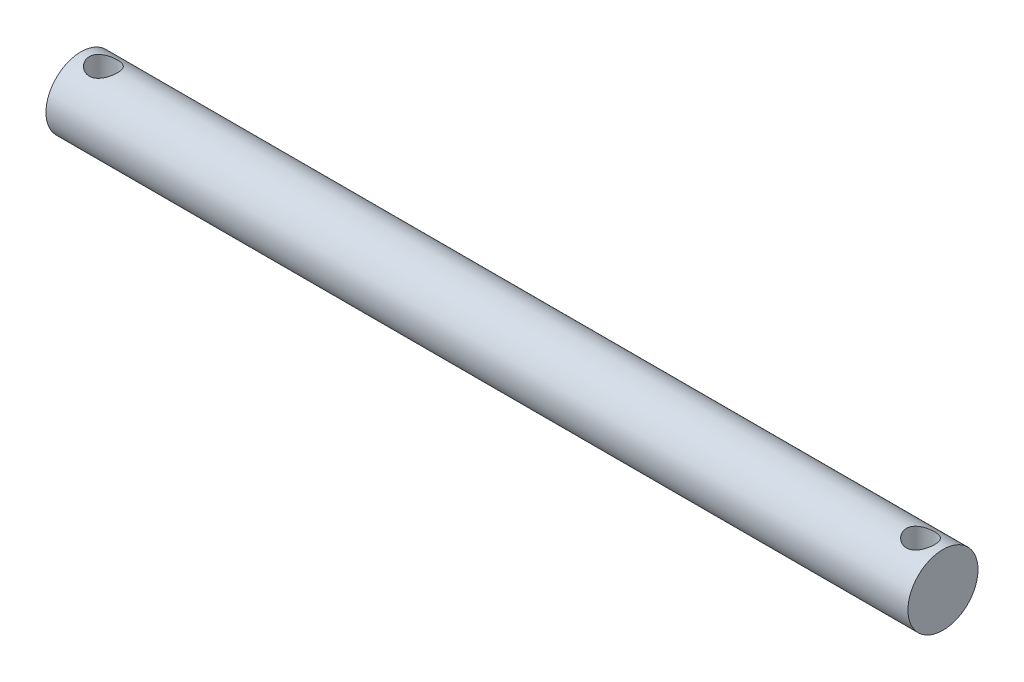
ISO-10303-21;
HEADER;
FILE_DESCRIPTION(('STEP AP214'),'2;1');
FILE_NAME('part.step','',(''),(''),'','','');
FILE_SCHEMA(('AUTOMOTIVE_DESIGN { 1 0 10303 214 1 1 1 1 }'));
ENDSEC;
DATA;
#1=APPLICATION_CONTEXT('core data for automotive mechanical design processes');
#2=APPLICATION_PROTOCOL_DEFINITION('international standard','automotive_design',2000,#1);
#3=PRODUCT_CONTEXT('',#1,'mechanical');
#4=PRODUCT('Part','Part','',(#3));
#5=PRODUCT_RELATED_PRODUCT_CATEGORY('part','',(#4));
#6=PRODUCT_DEFINITION_FORMATION('','',#4);
#7=PRODUCT_DEFINITION_CONTEXT('part definition',#1,'design');
#8=PRODUCT_DEFINITION('design','',#6,#7);
#9=PRODUCT_DEFINITION_SHAPE('','',#8);
#10=(LENGTH_UNIT() NAMED_UNIT(*) SI_UNIT(.MILLI.,.METRE.));
#11=(NAMED_UNIT(*) PLANE_ANGLE_UNIT() SI_UNIT($,.RADIAN.));
#12=(NAMED_UNIT(*) SI_UNIT($,.STERADIAN.) SOLID_ANGLE_UNIT());
#13=UNCERTAINTY_MEASURE_WITH_UNIT(LENGTH_MEASURE(1.E-05),#10,'distance_accuracy_value','');
#14=(GEOMETRIC_REPRESENTATION_CONTEXT(3) GLOBAL_UNCERTAINTY_ASSIGNED_CONTEXT((#13)) GLOBAL_UNIT_ASSIGNED_CONTEXT((#10,
#11,#12)) REPRESENTATION_CONTEXT('',''));
#15=CARTESIAN_POINT('',(0.,0.,0.));
#16=DIRECTION('',(0.,0.,1.));
#17=DIRECTION('',(1.,0.,0.));
#18=AXIS2_PLACEMENT_3D('',#15,#16,#17);
#19=CARTESIAN_POINT('',(78.105,0.,0.));
#20=DIRECTION('',(-1.,0.,0.));
#21=DIRECTION('',(0.,0.,1.));
#22=AXIS2_PLACEMENT_3D('',#19,#20,#21);
#23=CYLINDRICAL_SURFACE('',#22,6.35);
#24=CARTESIAN_POINT('',(-74.041,-5.81431188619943,2.55270000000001));
#25=CARTESIAN_POINT('',(-73.9043557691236,-5.81432078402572,2.55269056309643));
#26=CARTESIAN_POINT('',(-73.7674834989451,-5.81919700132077,2.54166134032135));
#27=CARTESIAN_POINT('',(-73.4976528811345,-5.83808211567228,2.49796596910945));
#28=CARTESIAN_POINT('',(-73.3647065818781,-5.85211657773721,2.46523924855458));
#29=CARTESIAN_POINT('',(-73.107114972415,-5.88745604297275,2.37959664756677));
#30=CARTESIAN_POINT('',(-72.9824395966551,-5.90873276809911,2.32675919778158));
#31=CARTESIAN_POINT('',(-72.7437618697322,-5.95611774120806,2.20262513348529));
#32=CARTESIAN_POINT('',(-72.6297564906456,-5.98222461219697,2.13133377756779));
#33=CARTESIAN_POINT('',(-72.4089877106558,-6.03801938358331,1.96790421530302));
#34=CARTESIAN_POINT('',(-72.3029172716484,-6.06782326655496,1.87486906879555));
#35=CARTESIAN_POINT('',(-72.1073760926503,-6.12669683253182,1.67247917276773));
#36=CARTESIAN_POINT('',(-72.0179114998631,-6.15576624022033,1.56311840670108));
#37=CARTESIAN_POINT('',(-71.854674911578,-6.2112885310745,1.32582206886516));
#38=CARTESIAN_POINT('',(-71.7816711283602,-6.2375908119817,1.19731961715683));
#39=CARTESIAN_POINT('',(-71.6586129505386,-6.28320858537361,0.928611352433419));
#40=CARTESIAN_POINT('',(-71.608549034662,-6.30252697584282,0.788410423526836));
#41=CARTESIAN_POINT('',(-71.5352679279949,-6.33117951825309,0.507548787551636));
#42=CARTESIAN_POINT('',(-71.5108589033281,-6.34095524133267,0.367245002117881));
#43=CARTESIAN_POINT('',(-71.4857411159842,-6.35101796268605,0.0842150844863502));
#44=CARTESIAN_POINT('',(-71.4850234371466,-6.35130853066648,-0.058510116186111));
#45=CARTESIAN_POINT('',(-71.5066587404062,-6.34263586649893,-0.333710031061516));
#46=CARTESIAN_POINT('',(-71.5277053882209,-6.33419660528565,-0.466306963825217));
#47=CARTESIAN_POINT('',(-71.5900478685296,-6.30972037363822,-0.725902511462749));
#48=CARTESIAN_POINT('',(-71.6313451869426,-6.29368284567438,-0.85290071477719));
#49=CARTESIAN_POINT('',(-71.7335223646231,-6.25527046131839,-1.09998813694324));
#50=CARTESIAN_POINT('',(-71.7946885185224,-6.2328035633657,-1.21994406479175));
#51=CARTESIAN_POINT('',(-71.9345974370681,-6.18375837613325,-1.44819941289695));
#52=CARTESIAN_POINT('',(-72.0133462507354,-6.15717867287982,-1.55649480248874));
#53=CARTESIAN_POINT('',(-72.1922623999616,-6.10052388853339,-1.76597068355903));
#54=CARTESIAN_POINT('',(-72.2935028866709,-6.07033389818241,-1.86620487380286));
#55=CARTESIAN_POINT('',(-72.5114680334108,-6.01121444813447,-2.04866288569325));
#56=CARTESIAN_POINT('',(-72.6281978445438,-5.9822854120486,-2.13088069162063));
#57=CARTESIAN_POINT('',(-72.8781007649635,-5.92817714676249,-2.2771673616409));
#58=CARTESIAN_POINT('',(-73.0116503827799,-5.90312977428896,-2.34064590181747));
#59=CARTESIAN_POINT('',(-73.2888187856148,-5.86116973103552,-2.44383495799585));
#60=CARTESIAN_POINT('',(-73.4324308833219,-5.84425171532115,-2.48356109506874));
#61=CARTESIAN_POINT('',(-73.716202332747,-5.82176658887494,-2.53580333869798));
#62=CARTESIAN_POINT('',(-73.8560300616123,-5.8155648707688,-2.54984384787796));
#63=CARTESIAN_POINT('',(-74.1361507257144,-5.81340577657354,-2.55476599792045));
#64=CARTESIAN_POINT('',(-74.2764435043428,-5.81744524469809,-2.5456547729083));
#65=CARTESIAN_POINT('',(-74.5449884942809,-5.83466155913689,-2.50592044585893));
#66=CARTESIAN_POINT('',(-74.6734680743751,-5.8472970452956,-2.47657052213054));
#67=CARTESIAN_POINT('',(-74.9235914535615,-5.87960775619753,-2.3988477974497));
#68=CARTESIAN_POINT('',(-75.0452337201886,-5.89928455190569,-2.35047075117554));
#69=CARTESIAN_POINT('',(-75.283762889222,-5.94444209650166,-2.23386605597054));
#70=CARTESIAN_POINT('',(-75.4002535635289,-5.97012681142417,-2.16490933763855));
#71=CARTESIAN_POINT('',(-75.6205437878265,-6.02409766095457,-2.00984566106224));
#72=CARTESIAN_POINT('',(-75.7243381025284,-6.05238486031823,-1.92373166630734));
#73=CARTESIAN_POINT('',(-75.924354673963,-6.11092633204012,-1.72920025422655));
#74=CARTESIAN_POINT('',(-76.0194310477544,-6.14116959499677,-1.6195968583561));
#75=CARTESIAN_POINT('',(-76.1900229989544,-6.19822940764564,-1.38527123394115));
#76=CARTESIAN_POINT('',(-76.2655377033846,-6.22504580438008,-1.26054833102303));
#77=CARTESIAN_POINT('',(-76.3946051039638,-6.27232521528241,-0.999035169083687));
#78=CARTESIAN_POINT('',(-76.4481563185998,-6.29278780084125,-0.862244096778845));
#79=CARTESIAN_POINT('',(-76.5311286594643,-6.32498898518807,-0.580568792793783));
#80=CARTESIAN_POINT('',(-76.5605630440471,-6.33673237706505,-0.435689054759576));
#81=CARTESIAN_POINT('',(-76.5928816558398,-6.34965560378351,-0.152231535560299));
#82=CARTESIAN_POINT('',(-76.5973854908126,-6.35147969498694,-0.013866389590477));
#83=CARTESIAN_POINT('',(-76.5840013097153,-6.34610419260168,0.261582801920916));
#84=CARTESIAN_POINT('',(-76.5661167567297,-6.33890599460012,0.398667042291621));
#85=CARTESIAN_POINT('',(-76.5096218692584,-6.31661907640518,0.663265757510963));
#86=CARTESIAN_POINT('',(-76.4716771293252,-6.30178413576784,0.79094543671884));
#87=CARTESIAN_POINT('',(-76.3768411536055,-6.26581656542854,1.03810147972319));
#88=CARTESIAN_POINT('',(-76.3199461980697,-6.24468269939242,1.15757622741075));
#89=CARTESIAN_POINT('',(-76.1859825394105,-6.19702254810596,1.39075615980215));
#90=CARTESIAN_POINT('',(-76.1081308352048,-6.17029863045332,1.5039702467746));
#91=CARTESIAN_POINT('',(-75.935641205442,-6.11467302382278,1.71619612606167));
#92=CARTESIAN_POINT('',(-75.8409976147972,-6.08577060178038,1.81520310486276));
#93=CARTESIAN_POINT('',(-75.6306049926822,-6.02679568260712,2.00262016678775));
#94=CARTESIAN_POINT('',(-75.5139067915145,-5.99676289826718,2.08998173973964));
#95=CARTESIAN_POINT('',(-75.2665612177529,-5.94085078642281,2.24399790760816));
#96=CARTESIAN_POINT('',(-75.1359063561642,-5.91497370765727,2.31064130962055));
#97=CARTESIAN_POINT('',(-74.8650886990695,-5.87092588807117,2.4203807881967));
#98=CARTESIAN_POINT('',(-74.7250234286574,-5.85268705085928,2.4636859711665));
#99=CARTESIAN_POINT('',(-74.5106224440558,-5.83280890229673,2.51019841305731));
#100=CARTESIAN_POINT('',(-74.4385097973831,-5.82743112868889,2.52262521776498));
#101=CARTESIAN_POINT('',(-74.2933497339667,-5.81933701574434,2.54124600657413));
#102=CARTESIAN_POINT('',(-74.2203030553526,-5.81661869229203,2.54744463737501));
#103=CARTESIAN_POINT('',(-74.1117819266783,-5.8146339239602,2.5519653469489));
#104=CARTESIAN_POINT('',(-74.0763986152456,-5.81430958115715,2.55270244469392));
#105=CARTESIAN_POINT('',(-74.041,-5.81431188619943,2.55270000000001));
#106=B_SPLINE_CURVE_WITH_KNOTS('',3,(#24,#25,#26,#27,#28,#29,#30,#31,#32,#33,#34,#35,#36,#37,
#38,#39,#40,#41,#42,#43,#44,#45,#46,#47,#48,#49,#50,#51,#52,#53,#54,#55,#56,#57,#58,#59,#60,#61,
#62,#63,#64,#65,#66,#67,#68,#69,#70,#71,#72,#73,#74,#75,#76,#77,#78,#79,#80,#81,#82,#83,#84,#85,
#86,#87,#88,#89,#90,#91,#92,#93,#94,#95,#96,#97,#98,#99,#100,#101,#102,#103,#104,#105),
.UNSPECIFIED.,.T.,.F.,(4,2,2,2,2,2,2,2,2,2,2,2,2,2,2,2,2,2,2,2,2,2,2,2,2,2,2,2,2,2,2,2,2,2,2,2,
2,2,2,2,4),(0.,0.409813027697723,0.820774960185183,1.2301503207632,1.63940915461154,
2.07012276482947,2.50099550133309,2.94905343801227,3.39692523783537,3.82292176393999,
4.24875796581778,4.65043934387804,5.05215020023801,5.45992720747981,5.86784472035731,
6.30277962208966,6.73785952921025,7.18545908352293,7.63276394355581,8.05253470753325,
8.47217613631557,8.86757432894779,9.26306079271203,9.67467552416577,10.0864594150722,
10.5290226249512,10.9716055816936,11.4142183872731,11.8565877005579,12.2698481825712,
12.6830447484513,13.0833204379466,13.4836747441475,13.9017901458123,14.3200468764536,
14.7644347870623,15.209062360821,15.6496369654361,15.8695010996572,16.0892010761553,
16.1953659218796),.UNSPECIFIED.);
#107=CARTESIAN_POINT('',(-74.041,-5.81431188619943,2.55270000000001));
#108=VERTEX_POINT('',#107);
#109=EDGE_CURVE('E10',#108,#108,#106,.T.);
#110=ORIENTED_EDGE('',*,*,#109,.T.);
#111=EDGE_LOOP('',(#110));
#112=FACE_BOUND('',#111,.T.);
#113=CARTESIAN_POINT('',(-74.041,5.81431188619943,2.55270000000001));
#114=CARTESIAN_POINT('',(-74.1776442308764,5.81432078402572,2.55269056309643));
#115=CARTESIAN_POINT('',(-74.3145165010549,5.81919700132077,2.54166134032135));
#116=CARTESIAN_POINT('',(-74.5843471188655,5.83808211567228,2.49796596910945));
#117=CARTESIAN_POINT('',(-74.7172934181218,5.85211657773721,2.46523924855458));
#118=CARTESIAN_POINT('',(-74.974885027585,5.88745604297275,2.37959664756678));
#119=CARTESIAN_POINT('',(-75.0995604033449,5.90873276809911,2.32675919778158));
#120=CARTESIAN_POINT('',(-75.3382381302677,5.95611774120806,2.2026251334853));
#121=CARTESIAN_POINT('',(-75.4522435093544,5.98222461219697,2.1313337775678));
#122=CARTESIAN_POINT('',(-75.6730122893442,6.03801938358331,1.96790421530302));
#123=CARTESIAN_POINT('',(-75.7790827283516,6.06782326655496,1.87486906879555));
#124=CARTESIAN_POINT('',(-75.9746239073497,6.12669683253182,1.67247917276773));
#125=CARTESIAN_POINT('',(-76.0640885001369,6.15576624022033,1.56311840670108));
#126=CARTESIAN_POINT('',(-76.227325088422,6.2112885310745,1.32582206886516));
#127=CARTESIAN_POINT('',(-76.3003288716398,6.2375908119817,1.19731961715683));
#128=CARTESIAN_POINT('',(-76.4233870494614,6.28320858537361,0.928611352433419));
#129=CARTESIAN_POINT('',(-76.473450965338,6.30252697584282,0.788410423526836));
#130=CARTESIAN_POINT('',(-76.5467320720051,6.33117951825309,0.507548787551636));
#131=CARTESIAN_POINT('',(-76.5711410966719,6.34095524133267,0.367245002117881));
#132=CARTESIAN_POINT('',(-76.5962588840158,6.35101796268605,0.0842150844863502));
#133=CARTESIAN_POINT('',(-76.5969765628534,6.35130853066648,-0.0585101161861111));
#134=CARTESIAN_POINT('',(-76.5753412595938,6.34263586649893,-0.333710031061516));
#135=CARTESIAN_POINT('',(-76.5542946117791,6.33419660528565,-0.466306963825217));
#136=CARTESIAN_POINT('',(-76.4919521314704,6.30972037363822,-0.725902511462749));
#137=CARTESIAN_POINT('',(-76.4506548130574,6.29368284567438,-0.85290071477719));
#138=CARTESIAN_POINT('',(-76.3484776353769,6.25527046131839,-1.09998813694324));
#139=CARTESIAN_POINT('',(-76.2873114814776,6.2328035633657,-1.21994406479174));
#140=CARTESIAN_POINT('',(-76.1474025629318,6.18375837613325,-1.44819941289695));
#141=CARTESIAN_POINT('',(-76.0686537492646,6.15717867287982,-1.55649480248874));
#142=CARTESIAN_POINT('',(-75.8897376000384,6.10052388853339,-1.76597068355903));
#143=CARTESIAN_POINT('',(-75.7884971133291,6.07033389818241,-1.86620487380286));
#144=CARTESIAN_POINT('',(-75.5705319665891,6.01121444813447,-2.04866288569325));
#145=CARTESIAN_POINT('',(-75.4538021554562,5.9822854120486,-2.13088069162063));
#146=CARTESIAN_POINT('',(-75.2038992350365,5.92817714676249,-2.2771673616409));
#147=CARTESIAN_POINT('',(-75.0703496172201,5.90312977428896,-2.34064590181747));
#148=CARTESIAN_POINT('',(-74.7931812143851,5.86116973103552,-2.44383495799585));
#149=CARTESIAN_POINT('',(-74.6495691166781,5.84425171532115,-2.48356109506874));
#150=CARTESIAN_POINT('',(-74.365797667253,5.82176658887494,-2.53580333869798));
#151=CARTESIAN_POINT('',(-74.2259699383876,5.8155648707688,-2.54984384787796));
#152=CARTESIAN_POINT('',(-73.9458492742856,5.81340577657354,-2.55476599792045));
#153=CARTESIAN_POINT('',(-73.8055564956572,5.81744524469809,-2.5456547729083));
#154=CARTESIAN_POINT('',(-73.5370115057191,5.83466155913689,-2.50592044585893));
#155=CARTESIAN_POINT('',(-73.4085319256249,5.8472970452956,-2.47657052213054));
#156=CARTESIAN_POINT('',(-73.1584085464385,5.87960775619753,-2.3988477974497));
#157=CARTESIAN_POINT('',(-73.0367662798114,5.89928455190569,-2.35047075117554));
#158=CARTESIAN_POINT('',(-72.798237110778,5.94444209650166,-2.23386605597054));
#159=CARTESIAN_POINT('',(-72.6817464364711,5.97012681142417,-2.16490933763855));
#160=CARTESIAN_POINT('',(-72.4614562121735,6.02409766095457,-2.00984566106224));
#161=CARTESIAN_POINT('',(-72.3576618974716,6.05238486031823,-1.92373166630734));
#162=CARTESIAN_POINT('',(-72.157645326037,6.11092633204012,-1.72920025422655));
#163=CARTESIAN_POINT('',(-72.0625689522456,6.14116959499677,-1.6195968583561));
#164=CARTESIAN_POINT('',(-71.8919770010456,6.19822940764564,-1.38527123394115));
#165=CARTESIAN_POINT('',(-71.8164622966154,6.22504580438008,-1.26054833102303));
#166=CARTESIAN_POINT('',(-71.6873948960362,6.27232521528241,-0.999035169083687));
#167=CARTESIAN_POINT('',(-71.6338436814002,6.29278780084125,-0.862244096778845));
#168=CARTESIAN_POINT('',(-71.5508713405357,6.32498898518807,-0.580568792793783));
#169=CARTESIAN_POINT('',(-71.5214369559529,6.33673237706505,-0.435689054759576));
#170=CARTESIAN_POINT('',(-71.4891183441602,6.34965560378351,-0.152231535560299));
#171=CARTESIAN_POINT('',(-71.4846145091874,6.35147969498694,-0.013866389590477));
#172=CARTESIAN_POINT('',(-71.4979986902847,6.34610419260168,0.261582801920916));
#173=CARTESIAN_POINT('',(-71.5158832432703,6.33890599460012,0.398667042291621));
#174=CARTESIAN_POINT('',(-71.5723781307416,6.31661907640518,0.663265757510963));
#175=CARTESIAN_POINT('',(-71.6103228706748,6.30178413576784,0.79094543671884));
#176=CARTESIAN_POINT('',(-71.7051588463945,6.26581656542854,1.03810147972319));
#177=CARTESIAN_POINT('',(-71.7620538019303,6.24468269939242,1.15757622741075));
#178=CARTESIAN_POINT('',(-71.8960174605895,6.19702254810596,1.39075615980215));
#179=CARTESIAN_POINT('',(-71.9738691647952,6.17029863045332,1.5039702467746));
#180=CARTESIAN_POINT('',(-72.146358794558,6.11467302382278,1.71619612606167));
#181=CARTESIAN_POINT('',(-72.2410023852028,6.08577060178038,1.81520310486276));
#182=CARTESIAN_POINT('',(-72.4513950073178,6.02679568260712,2.00262016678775));
#183=CARTESIAN_POINT('',(-72.5680932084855,5.99676289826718,2.08998173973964));
#184=CARTESIAN_POINT('',(-72.8154387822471,5.94085078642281,2.24399790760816));
#185=CARTESIAN_POINT('',(-72.9460936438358,5.91497370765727,2.31064130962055));
#186=CARTESIAN_POINT('',(-73.2169113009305,5.87092588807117,2.4203807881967));
#187=CARTESIAN_POINT('',(-73.3569765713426,5.85268705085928,2.4636859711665));
#188=CARTESIAN_POINT('',(-73.5713775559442,5.83280890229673,2.51019841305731));
#189=CARTESIAN_POINT('',(-73.6434902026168,5.82743112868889,2.52262521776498));
#190=CARTESIAN_POINT('',(-73.7886502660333,5.81933701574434,2.54124600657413));
#191=CARTESIAN_POINT('',(-73.8616969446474,5.81661869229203,2.54744463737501));
#192=CARTESIAN_POINT('',(-73.9702180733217,5.8146339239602,2.5519653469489));
#193=CARTESIAN_POINT('',(-74.0056013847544,5.81430958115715,2.55270244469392));
#194=CARTESIAN_POINT('',(-74.041,5.81431188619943,2.55270000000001));
#195=B_SPLINE_CURVE_WITH_KNOTS('',3,(#113,#114,#115,#116,#117,#118,#119,#120,#121,#122,#123,
#124,#125,#126,#127,#128,#129,#130,#131,#132,#133,#134,#135,#136,#137,#138,#139,#140,#141,#142,
#143,#144,#145,#146,#147,#148,#149,#150,#151,#152,#153,#154,#155,#156,#157,#158,#159,#160,#161,
#162,#163,#164,#165,#166,#167,#168,#169,#170,#171,#172,#173,#174,#175,#176,#177,#178,#179,#180,
#181,#182,#183,#184,#185,#186,#187,#188,#189,#190,#191,#192,#193,#194),.UNSPECIFIED.,.T.,.F.,(4,
2,2,2,2,2,2,2,2,2,2,2,2,2,2,2,2,2,2,2,2,2,2,2,2,2,2,2,2,2,2,2,2,2,2,2,2,2,2,2,4),(0.,
0.409813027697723,0.820774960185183,1.23015032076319,1.63940915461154,2.07012276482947,
2.50099550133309,2.94905343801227,3.39692523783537,3.82292176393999,4.24875796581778,
4.65043934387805,5.05215020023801,5.4599272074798,5.86784472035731,6.30277962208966,
6.73785952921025,7.18545908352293,7.63276394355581,8.05253470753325,8.47217613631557,
8.86757432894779,9.26306079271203,9.67467552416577,10.0864594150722,10.5290226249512,
10.9716055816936,11.4142183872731,11.8565877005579,12.2698481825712,12.6830447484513,
13.0833204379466,13.4836747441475,13.9017901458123,14.3200468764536,14.7644347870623,
15.209062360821,15.6496369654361,15.8695010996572,16.0892010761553,16.1953659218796),.UNSPECIFIED.);
#196=CARTESIAN_POINT('',(-74.041,5.81431188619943,2.55270000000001));
#197=VERTEX_POINT('',#196);
#198=EDGE_CURVE('E41',#197,#197,#195,.T.);
#199=ORIENTED_EDGE('',*,*,#198,.T.);
#200=EDGE_LOOP('',(#199));
#201=FACE_BOUND('',#200,.T.);
#202=CARTESIAN_POINT('',(74.041,-5.81431188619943,2.55270000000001));
#203=CARTESIAN_POINT('',(74.1776442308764,-5.81432078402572,2.55269056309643));
#204=CARTESIAN_POINT('',(74.3145165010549,-5.81919700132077,2.54166134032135));
#205=CARTESIAN_POINT('',(74.5843471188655,-5.83808211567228,2.49796596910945));
#206=CARTESIAN_POINT('',(74.7172934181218,-5.85211657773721,2.46523924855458));
#207=CARTESIAN_POINT('',(74.974885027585,-5.88745604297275,2.37959664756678));
#208=CARTESIAN_POINT('',(75.0995604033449,-5.90873276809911,2.32675919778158));
#209=CARTESIAN_POINT('',(75.3382381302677,-5.95611774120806,2.2026251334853));
#210=CARTESIAN_POINT('',(75.4522435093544,-5.98222461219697,2.1313337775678));
#211=CARTESIAN_POINT('',(75.6730122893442,-6.03801938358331,1.96790421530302));
#212=CARTESIAN_POINT('',(75.7790827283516,-6.06782326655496,1.87486906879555));
#213=CARTESIAN_POINT('',(75.9746239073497,-6.12669683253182,1.67247917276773));
#214=CARTESIAN_POINT('',(76.0640885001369,-6.15576624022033,1.56311840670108));
#215=CARTESIAN_POINT('',(76.227325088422,-6.2112885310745,1.32582206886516));
#216=CARTESIAN_POINT('',(76.3003288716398,-6.2375908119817,1.19731961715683));
#217=CARTESIAN_POINT('',(76.4233870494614,-6.28320858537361,0.928611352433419));
#218=CARTESIAN_POINT('',(76.473450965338,-6.30252697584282,0.788410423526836));
#219=CARTESIAN_POINT('',(76.5467320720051,-6.33117951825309,0.507548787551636));
#220=CARTESIAN_POINT('',(76.5711410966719,-6.34095524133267,0.367245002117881));
#221=CARTESIAN_POINT('',(76.5962588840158,-6.35101796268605,0.0842150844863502));
#222=CARTESIAN_POINT('',(76.5969765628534,-6.35130853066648,-0.0585101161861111));
#223=CARTESIAN_POINT('',(76.5753412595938,-6.34263586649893,-0.333710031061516));
#224=CARTESIAN_POINT('',(76.5542946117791,-6.33419660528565,-0.466306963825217));
#225=CARTESIAN_POINT('',(76.4919521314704,-6.30972037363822,-0.725902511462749));
#226=CARTESIAN_POINT('',(76.4506548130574,-6.29368284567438,-0.85290071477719));
#227=CARTESIAN_POINT('',(76.3484776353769,-6.25527046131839,-1.09998813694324));
#228=CARTESIAN_POINT('',(76.2873114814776,-6.2328035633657,-1.21994406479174));
#229=CARTESIAN_POINT('',(76.1474025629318,-6.18375837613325,-1.44819941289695));
#230=CARTESIAN_POINT('',(76.0686537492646,-6.15717867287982,-1.55649480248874));
#231=CARTESIAN_POINT('',(75.8897376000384,-6.10052388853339,-1.76597068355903));
#232=CARTESIAN_POINT('',(75.7884971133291,-6.07033389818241,-1.86620487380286));
#233=CARTESIAN_POINT('',(75.5705319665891,-6.01121444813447,-2.04866288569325));
#234=CARTESIAN_POINT('',(75.4538021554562,-5.9822854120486,-2.13088069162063));
#235=CARTESIAN_POINT('',(75.2038992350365,-5.92817714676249,-2.2771673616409));
#236=CARTESIAN_POINT('',(75.0703496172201,-5.90312977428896,-2.34064590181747));
#237=CARTESIAN_POINT('',(74.7931812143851,-5.86116973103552,-2.44383495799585));
#238=CARTESIAN_POINT('',(74.6495691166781,-5.84425171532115,-2.48356109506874));
#239=CARTESIAN_POINT('',(74.365797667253,-5.82176658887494,-2.53580333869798));
#240=CARTESIAN_POINT('',(74.2259699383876,-5.8155648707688,-2.54984384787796));
#241=CARTESIAN_POINT('',(73.9458492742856,-5.81340577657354,-2.55476599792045));
#242=CARTESIAN_POINT('',(73.8055564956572,-5.81744524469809,-2.5456547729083));
#243=CARTESIAN_POINT('',(73.5370115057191,-5.83466155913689,-2.50592044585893));
#244=CARTESIAN_POINT('',(73.4085319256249,-5.8472970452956,-2.47657052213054));
#245=CARTESIAN_POINT('',(73.1584085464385,-5.87960775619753,-2.3988477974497));
#246=CARTESIAN_POINT('',(73.0367662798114,-5.89928455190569,-2.35047075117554));
#247=CARTESIAN_POINT('',(72.798237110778,-5.94444209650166,-2.23386605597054));
#248=CARTESIAN_POINT('',(72.6817464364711,-5.97012681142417,-2.16490933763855));
#249=CARTESIAN_POINT('',(72.4614562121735,-6.02409766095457,-2.00984566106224));
#250=CARTESIAN_POINT('',(72.3576618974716,-6.05238486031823,-1.92373166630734));
#251=CARTESIAN_POINT('',(72.157645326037,-6.11092633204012,-1.72920025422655));
#252=CARTESIAN_POINT('',(72.0625689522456,-6.14116959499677,-1.6195968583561));
#253=CARTESIAN_POINT('',(71.8919770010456,-6.19822940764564,-1.38527123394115));
#254=CARTESIAN_POINT('',(71.8164622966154,-6.22504580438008,-1.26054833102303));
#255=CARTESIAN_POINT('',(71.6873948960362,-6.27232521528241,-0.999035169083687));
#256=CARTESIAN_POINT('',(71.6338436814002,-6.29278780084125,-0.862244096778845));
#257=CARTESIAN_POINT('',(71.5508713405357,-6.32498898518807,-0.580568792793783));
#258=CARTESIAN_POINT('',(71.5214369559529,-6.33673237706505,-0.435689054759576));
#259=CARTESIAN_POINT('',(71.4891183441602,-6.34965560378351,-0.152231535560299));
#260=CARTESIAN_POINT('',(71.4846145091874,-6.35147969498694,-0.013866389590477));
#261=CARTESIAN_POINT('',(71.4979986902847,-6.34610419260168,0.261582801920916));
#262=CARTESIAN_POINT('',(71.5158832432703,-6.33890599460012,0.398667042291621));
#263=CARTESIAN_POINT('',(71.5723781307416,-6.31661907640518,0.663265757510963));
#264=CARTESIAN_POINT('',(71.6103228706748,-6.30178413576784,0.79094543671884));
#265=CARTESIAN_POINT('',(71.7051588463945,-6.26581656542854,1.03810147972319));
#266=CARTESIAN_POINT('',(71.7620538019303,-6.24468269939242,1.15757622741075));
#267=CARTESIAN_POINT('',(71.8960174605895,-6.19702254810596,1.39075615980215));
#268=CARTESIAN_POINT('',(71.9738691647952,-6.17029863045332,1.5039702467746));
#269=CARTESIAN_POINT('',(72.146358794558,-6.11467302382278,1.71619612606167));
#270=CARTESIAN_POINT('',(72.2410023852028,-6.08577060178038,1.81520310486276));
#271=CARTESIAN_POINT('',(72.4513950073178,-6.02679568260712,2.00262016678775));
#272=CARTESIAN_POINT('',(72.5680932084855,-5.99676289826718,2.08998173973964));
#273=CARTESIAN_POINT('',(72.8154387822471,-5.94085078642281,2.24399790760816));
#274=CARTESIAN_POINT('',(72.9460936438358,-5.91497370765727,2.31064130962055));
#275=CARTESIAN_POINT('',(73.2169113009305,-5.87092588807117,2.4203807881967));
#276=CARTESIAN_POINT('',(73.3569765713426,-5.85268705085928,2.4636859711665));
#277=CARTESIAN_POINT('',(73.5713775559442,-5.83280890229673,2.51019841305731));
#278=CARTESIAN_POINT('',(73.6434902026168,-5.82743112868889,2.52262521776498));
#279=CARTESIAN_POINT('',(73.7886502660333,-5.81933701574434,2.54124600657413));
#280=CARTESIAN_POINT('',(73.8616969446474,-5.81661869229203,2.54744463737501));
#281=CARTESIAN_POINT('',(73.9702180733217,-5.8146339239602,2.5519653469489));
#282=CARTESIAN_POINT('',(74.0056013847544,-5.81430958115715,2.55270244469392));
#283=CARTESIAN_POINT('',(74.041,-5.81431188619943,2.55270000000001));
#284=B_SPLINE_CURVE_WITH_KNOTS('',3,(#202,#203,#204,#205,#206,#207,#208,#209,#210,#211,#212,
#213,#214,#215,#216,#217,#218,#219,#220,#221,#222,#223,#224,#225,#226,#227,#228,#229,#230,#231,
#232,#233,#234,#235,#236,#237,#238,#239,#240,#241,#242,#243,#244,#245,#246,#247,#248,#249,#250,
#251,#252,#253,#254,#255,#256,#257,#258,#259,#260,#261,#262,#263,#264,#265,#266,#267,#268,#269,
#270,#271,#272,#273,#274,#275,#276,#277,#278,#279,#280,#281,#282,#283),.UNSPECIFIED.,.T.,.F.,(4,
2,2,2,2,2,2,2,2,2,2,2,2,2,2,2,2,2,2,2,2,2,2,2,2,2,2,2,2,2,2,2,2,2,2,2,2,2,2,2,4),(0.,
0.409813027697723,0.820774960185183,1.23015032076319,1.63940915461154,2.07012276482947,
2.50099550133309,2.94905343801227,3.39692523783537,3.82292176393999,4.24875796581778,
4.65043934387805,5.05215020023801,5.4599272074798,5.86784472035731,6.30277962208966,
6.73785952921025,7.18545908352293,7.63276394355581,8.05253470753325,8.47217613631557,
8.86757432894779,9.26306079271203,9.67467552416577,10.0864594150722,10.5290226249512,
10.9716055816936,11.4142183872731,11.8565877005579,12.2698481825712,12.6830447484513,
13.0833204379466,13.4836747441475,13.9017901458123,14.3200468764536,14.7644347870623,
15.209062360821,15.6496369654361,15.8695010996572,16.0892010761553,16.1953659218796),.UNSPECIFIED.);
#285=CARTESIAN_POINT('',(74.041,-5.81431188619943,2.55270000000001));
#286=VERTEX_POINT('',#285);
#287=EDGE_CURVE('E45',#286,#286,#284,.T.);
#288=ORIENTED_EDGE('',*,*,#287,.T.);
#289=EDGE_LOOP('',(#288));
#290=FACE_BOUND('',#289,.T.);
#291=CARTESIAN_POINT('',(74.041,5.81431188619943,2.55270000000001));
#292=CARTESIAN_POINT('',(73.9043557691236,5.81432078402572,2.55269056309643));
#293=CARTESIAN_POINT('',(73.7674834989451,5.81919700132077,2.54166134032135));
#294=CARTESIAN_POINT('',(73.4976528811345,5.83808211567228,2.49796596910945));
#295=CARTESIAN_POINT('',(73.3647065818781,5.85211657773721,2.46523924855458));
#296=CARTESIAN_POINT('',(73.107114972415,5.88745604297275,2.37959664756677));
#297=CARTESIAN_POINT('',(72.9824395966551,5.90873276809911,2.32675919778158));
#298=CARTESIAN_POINT('',(72.7437618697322,5.95611774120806,2.20262513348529));
#299=CARTESIAN_POINT('',(72.6297564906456,5.98222461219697,2.13133377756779));
#300=CARTESIAN_POINT('',(72.4089877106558,6.03801938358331,1.96790421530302));
#301=CARTESIAN_POINT('',(72.3029172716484,6.06782326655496,1.87486906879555));
#302=CARTESIAN_POINT('',(72.1073760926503,6.12669683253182,1.67247917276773));
#303=CARTESIAN_POINT('',(72.0179114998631,6.15576624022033,1.56311840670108));
#304=CARTESIAN_POINT('',(71.854674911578,6.2112885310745,1.32582206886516));
#305=CARTESIAN_POINT('',(71.7816711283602,6.2375908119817,1.19731961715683));
#306=CARTESIAN_POINT('',(71.6586129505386,6.28320858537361,0.928611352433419));
#307=CARTESIAN_POINT('',(71.608549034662,6.30252697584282,0.788410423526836));
#308=CARTESIAN_POINT('',(71.5352679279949,6.33117951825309,0.507548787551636));
#309=CARTESIAN_POINT('',(71.5108589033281,6.34095524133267,0.367245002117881));
#310=CARTESIAN_POINT('',(71.4857411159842,6.35101796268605,0.0842150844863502));
#311=CARTESIAN_POINT('',(71.4850234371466,6.35130853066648,-0.058510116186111));
#312=CARTESIAN_POINT('',(71.5066587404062,6.34263586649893,-0.333710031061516));
#313=CARTESIAN_POINT('',(71.5277053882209,6.33419660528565,-0.466306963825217));
#314=CARTESIAN_POINT('',(71.5900478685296,6.30972037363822,-0.725902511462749));
#315=CARTESIAN_POINT('',(71.6313451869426,6.29368284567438,-0.85290071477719));
#316=CARTESIAN_POINT('',(71.7335223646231,6.25527046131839,-1.09998813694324));
#317=CARTESIAN_POINT('',(71.7946885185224,6.2328035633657,-1.21994406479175));
#318=CARTESIAN_POINT('',(71.9345974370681,6.18375837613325,-1.44819941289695));
#319=CARTESIAN_POINT('',(72.0133462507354,6.15717867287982,-1.55649480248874));
#320=CARTESIAN_POINT('',(72.1922623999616,6.10052388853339,-1.76597068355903));
#321=CARTESIAN_POINT('',(72.2935028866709,6.07033389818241,-1.86620487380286));
#322=CARTESIAN_POINT('',(72.5114680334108,6.01121444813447,-2.04866288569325));
#323=CARTESIAN_POINT('',(72.6281978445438,5.9822854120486,-2.13088069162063));
#324=CARTESIAN_POINT('',(72.8781007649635,5.92817714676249,-2.2771673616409));
#325=CARTESIAN_POINT('',(73.0116503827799,5.90312977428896,-2.34064590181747));
#326=CARTESIAN_POINT('',(73.2888187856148,5.86116973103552,-2.44383495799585));
#327=CARTESIAN_POINT('',(73.4324308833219,5.84425171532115,-2.48356109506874));
#328=CARTESIAN_POINT('',(73.716202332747,5.82176658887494,-2.53580333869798));
#329=CARTESIAN_POINT('',(73.8560300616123,5.8155648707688,-2.54984384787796));
#330=CARTESIAN_POINT('',(74.1361507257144,5.81340577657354,-2.55476599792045));
#331=CARTESIAN_POINT('',(74.2764435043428,5.81744524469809,-2.5456547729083));
#332=CARTESIAN_POINT('',(74.5449884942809,5.83466155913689,-2.50592044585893));
#333=CARTESIAN_POINT('',(74.6734680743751,5.8472970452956,-2.47657052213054));
#334=CARTESIAN_POINT('',(74.9235914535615,5.87960775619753,-2.3988477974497));
#335=CARTESIAN_POINT('',(75.0452337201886,5.89928455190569,-2.35047075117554));
#336=CARTESIAN_POINT('',(75.283762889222,5.94444209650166,-2.23386605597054));
#337=CARTESIAN_POINT('',(75.4002535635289,5.97012681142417,-2.16490933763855));
#338=CARTESIAN_POINT('',(75.6205437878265,6.02409766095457,-2.00984566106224));
#339=CARTESIAN_POINT('',(75.7243381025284,6.05238486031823,-1.92373166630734));
#340=CARTESIAN_POINT('',(75.924354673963,6.11092633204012,-1.72920025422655));
#341=CARTESIAN_POINT('',(76.0194310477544,6.14116959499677,-1.6195968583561));
#342=CARTESIAN_POINT('',(76.1900229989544,6.19822940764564,-1.38527123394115));
#343=CARTESIAN_POINT('',(76.2655377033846,6.22504580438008,-1.26054833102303));
#344=CARTESIAN_POINT('',(76.3946051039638,6.27232521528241,-0.999035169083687));
#345=CARTESIAN_POINT('',(76.4481563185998,6.29278780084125,-0.862244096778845));
#346=CARTESIAN_POINT('',(76.5311286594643,6.32498898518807,-0.580568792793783));
#347=CARTESIAN_POINT('',(76.5605630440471,6.33673237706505,-0.435689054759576));
#348=CARTESIAN_POINT('',(76.5928816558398,6.34965560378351,-0.152231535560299));
#349=CARTESIAN_POINT('',(76.5973854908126,6.35147969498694,-0.013866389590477));
#350=CARTESIAN_POINT('',(76.5840013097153,6.34610419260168,0.261582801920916));
#351=CARTESIAN_POINT('',(76.5661167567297,6.33890599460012,0.398667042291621));
#352=CARTESIAN_POINT('',(76.5096218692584,6.31661907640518,0.663265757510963));
#353=CARTESIAN_POINT('',(76.4716771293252,6.30178413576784,0.79094543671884));
#354=CARTESIAN_POINT('',(76.3768411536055,6.26581656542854,1.03810147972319));
#355=CARTESIAN_POINT('',(76.3199461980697,6.24468269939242,1.15757622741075));
#356=CARTESIAN_POINT('',(76.1859825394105,6.19702254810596,1.39075615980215));
#357=CARTESIAN_POINT('',(76.1081308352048,6.17029863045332,1.5039702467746));
#358=CARTESIAN_POINT('',(75.935641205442,6.11467302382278,1.71619612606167));
#359=CARTESIAN_POINT('',(75.8409976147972,6.08577060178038,1.81520310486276));
#360=CARTESIAN_POINT('',(75.6306049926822,6.02679568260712,2.00262016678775));
#361=CARTESIAN_POINT('',(75.5139067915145,5.99676289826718,2.08998173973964));
#362=CARTESIAN_POINT('',(75.2665612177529,5.94085078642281,2.24399790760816));
#363=CARTESIAN_POINT('',(75.1359063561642,5.91497370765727,2.31064130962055));
#364=CARTESIAN_POINT('',(74.8650886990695,5.87092588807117,2.4203807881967));
#365=CARTESIAN_POINT('',(74.7250234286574,5.85268705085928,2.4636859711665));
#366=CARTESIAN_POINT('',(74.5106224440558,5.83280890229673,2.51019841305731));
#367=CARTESIAN_POINT('',(74.4385097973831,5.82743112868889,2.52262521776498));
#368=CARTESIAN_POINT('',(74.2933497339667,5.81933701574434,2.54124600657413));
#369=CARTESIAN_POINT('',(74.2203030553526,5.81661869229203,2.54744463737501));
#370=CARTESIAN_POINT('',(74.1117819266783,5.8146339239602,2.5519653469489));
#371=CARTESIAN_POINT('',(74.0763986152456,5.81430958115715,2.55270244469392));
#372=CARTESIAN_POINT('',(74.041,5.81431188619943,2.55270000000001));
#373=B_SPLINE_CURVE_WITH_KNOTS('',3,(#291,#292,#293,#294,#295,#296,#297,#298,#299,#300,#301,
#302,#303,#304,#305,#306,#307,#308,#309,#310,#311,#312,#313,#314,#315,#316,#317,#318,#319,#320,
#321,#322,#323,#324,#325,#326,#327,#328,#329,#330,#331,#332,#333,#334,#335,#336,#337,#338,#339,
#340,#341,#342,#343,#344,#345,#346,#347,#348,#349,#350,#351,#352,#353,#354,#355,#356,#357,#358,
#359,#360,#361,#362,#363,#364,#365,#366,#367,#368,#369,#370,#371,#372),.UNSPECIFIED.,.T.,.F.,(4,
2,2,2,2,2,2,2,2,2,2,2,2,2,2,2,2,2,2,2,2,2,2,2,2,2,2,2,2,2,2,2,2,2,2,2,2,2,2,2,4),(0.,
0.409813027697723,0.820774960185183,1.2301503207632,1.63940915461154,2.07012276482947,
2.50099550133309,2.94905343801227,3.39692523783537,3.82292176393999,4.24875796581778,
4.65043934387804,5.05215020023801,5.45992720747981,5.86784472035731,6.30277962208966,
6.73785952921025,7.18545908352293,7.63276394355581,8.05253470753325,8.47217613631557,
8.86757432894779,9.26306079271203,9.67467552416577,10.0864594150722,10.5290226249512,
10.9716055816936,11.4142183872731,11.8565877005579,12.2698481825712,12.6830447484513,
13.0833204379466,13.4836747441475,13.9017901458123,14.3200468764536,14.7644347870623,
15.209062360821,15.6496369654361,15.8695010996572,16.0892010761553,16.1953659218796),.UNSPECIFIED.);
#374=CARTESIAN_POINT('',(74.041,5.81431188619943,2.55270000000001));
#375=VERTEX_POINT('',#374);
#376=EDGE_CURVE('E49',#375,#375,#373,.T.);
#377=ORIENTED_EDGE('',*,*,#376,.T.);
#378=EDGE_LOOP('',(#377));
#379=FACE_BOUND('',#378,.T.);
#380=CARTESIAN_POINT('',(78.105,0.,0.));
#381=DIRECTION('',(1.,0.,0.));
#382=DIRECTION('',(0.,0.,-1.));
#383=AXIS2_PLACEMENT_3D('',#380,#381,#382);
#384=CIRCLE('',#383,6.35);
#385=CARTESIAN_POINT('',(78.105,0.,-6.35));
#386=VERTEX_POINT('',#385);
#387=EDGE_CURVE('E77',#386,#386,#384,.T.);
#388=ORIENTED_EDGE('',*,*,#387,.F.);
#389=EDGE_LOOP('',(#388));
#390=FACE_BOUND('',#389,.T.);
#391=CARTESIAN_POINT('',(-78.105,0.,0.));
#392=DIRECTION('',(1.,0.,0.));
#393=DIRECTION('',(0.,0.,-1.));
#394=AXIS2_PLACEMENT_3D('',#391,#392,#393);
#395=CIRCLE('',#394,6.35);
#396=CARTESIAN_POINT('',(-78.105,0.,-6.35));
#397=VERTEX_POINT('',#396);
#398=EDGE_CURVE('E78',#397,#397,#395,.T.);
#399=ORIENTED_EDGE('',*,*,#398,.T.);
#400=EDGE_LOOP('',(#399));
#401=FACE_BOUND('',#400,.T.);
#402=ADVANCED_FACE('F30',(#112,#201,#290,#379,#390,#401),#23,.T.);
#403=CARTESIAN_POINT('',(78.105,0.,0.));
#404=DIRECTION('',(1.,0.,0.));
#405=DIRECTION('',(0.,0.,-1.));
#406=AXIS2_PLACEMENT_3D('',#403,#404,#405);
#407=PLANE('',#406);
#408=ORIENTED_EDGE('',*,*,#387,.T.);
#409=EDGE_LOOP('',(#408));
#410=FACE_BOUND('',#409,.T.);
#411=ADVANCED_FACE('F70',(#410),#407,.T.);
#412=CARTESIAN_POINT('',(-78.105,0.,0.));
#413=DIRECTION('',(1.,0.,0.));
#414=DIRECTION('',(0.,0.,-1.));
#415=AXIS2_PLACEMENT_3D('',#412,#413,#414);
#416=PLANE('',#415);
#417=ORIENTED_EDGE('',*,*,#398,.F.);
#418=EDGE_LOOP('',(#417));
#419=FACE_BOUND('',#418,.T.);
#420=ADVANCED_FACE('F68',(#419),#416,.F.);
#421=CARTESIAN_POINT('',(74.041,-6.35,0.));
#422=DIRECTION('',(0.,1.,0.));
#423=DIRECTION('',(0.,0.,1.));
#424=AXIS2_PLACEMENT_3D('',#421,#422,#423);
#425=CYLINDRICAL_SURFACE('',#424,2.55270000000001);
#426=ORIENTED_EDGE('',*,*,#376,.F.);
#427=EDGE_LOOP('',(#426));
#428=FACE_BOUND('',#427,.T.);
#429=ORIENTED_EDGE('',*,*,#287,.F.);
#430=EDGE_LOOP('',(#429));
#431=FACE_BOUND('',#430,.T.);
#432=ADVANCED_FACE('F62',(#428,#431),#425,.F.);
#433=CARTESIAN_POINT('',(-74.041,-6.35,0.));
#434=DIRECTION('',(0.,1.,0.));
#435=DIRECTION('',(0.,0.,1.));
#436=AXIS2_PLACEMENT_3D('',#433,#434,#435);
#437=CYLINDRICAL_SURFACE('',#436,2.55270000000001);
#438=ORIENTED_EDGE('',*,*,#198,.F.);
#439=EDGE_LOOP('',(#438));
#440=FACE_BOUND('',#439,.T.);
#441=ORIENTED_EDGE('',*,*,#109,.F.);
#442=EDGE_LOOP('',(#441));
#443=FACE_BOUND('',#442,.T.);
#444=ADVANCED_FACE('F59',(#440,#443),#437,.F.);
#445=CLOSED_SHELL('',(#402,#411,#420,#432,#444));
#446=MANIFOLD_SOLID_BREP('B2',#445);
#447=ADVANCED_BREP_SHAPE_REPRESENTATION('',(#18,#446),#14);
#448=SHAPE_DEFINITION_REPRESENTATION(#9,#447);
ENDSEC;
END-ISO-10303-21;
